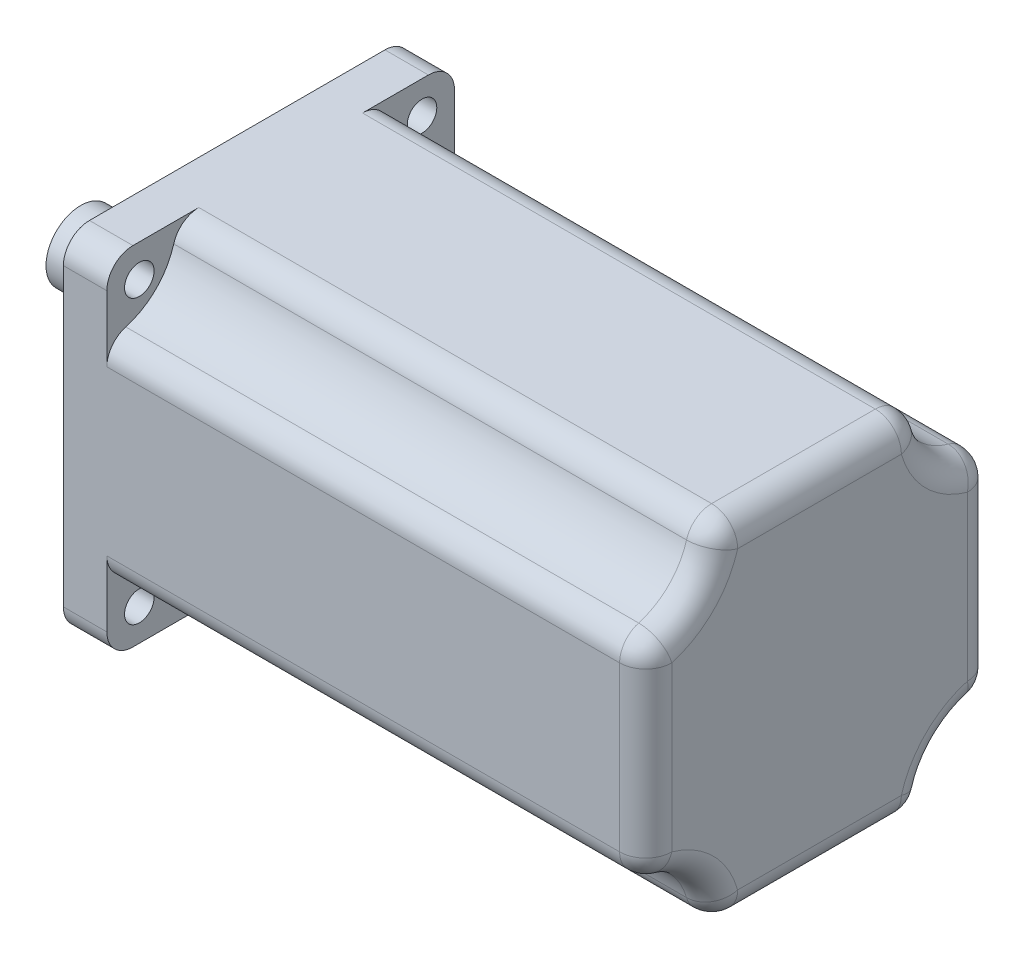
ISO-10303-21;
HEADER;
FILE_DESCRIPTION(('STEP AP214'),'2;1');
FILE_NAME('part.step','',(''),(''),'','','');
FILE_SCHEMA(('AUTOMOTIVE_DESIGN { 1 0 10303 214 1 1 1 1 }'));
ENDSEC;
DATA;
#1=APPLICATION_CONTEXT('core data for automotive mechanical design processes');
#2=APPLICATION_PROTOCOL_DEFINITION('international standard','automotive_design',2000,#1);
#3=PRODUCT_CONTEXT('',#1,'mechanical');
#4=PRODUCT('Part','Part','',(#3));
#5=PRODUCT_RELATED_PRODUCT_CATEGORY('part','',(#4));
#6=PRODUCT_DEFINITION_FORMATION('','',#4);
#7=PRODUCT_DEFINITION_CONTEXT('part definition',#1,'design');
#8=PRODUCT_DEFINITION('design','',#6,#7);
#9=PRODUCT_DEFINITION_SHAPE('','',#8);
#10=(LENGTH_UNIT() NAMED_UNIT(*) SI_UNIT(.MILLI.,.METRE.));
#11=(NAMED_UNIT(*) PLANE_ANGLE_UNIT() SI_UNIT($,.RADIAN.));
#12=(NAMED_UNIT(*) SI_UNIT($,.STERADIAN.) SOLID_ANGLE_UNIT());
#13=UNCERTAINTY_MEASURE_WITH_UNIT(LENGTH_MEASURE(1.E-05),#10,'distance_accuracy_value','');
#14=(GEOMETRIC_REPRESENTATION_CONTEXT(3) GLOBAL_UNCERTAINTY_ASSIGNED_CONTEXT((#13)) GLOBAL_UNIT_ASSIGNED_CONTEXT((#10,
#11,#12)) REPRESENTATION_CONTEXT('',''));
#15=CARTESIAN_POINT('',(0.,0.,0.));
#16=DIRECTION('',(0.,0.,1.));
#17=DIRECTION('',(1.,0.,0.));
#18=AXIS2_PLACEMENT_3D('',#15,#16,#17);
#19=CARTESIAN_POINT('',(-18.,0.,0.));
#20=DIRECTION('',(-1.,0.,0.));
#21=DIRECTION('',(0.,0.,1.));
#22=AXIS2_PLACEMENT_3D('',#19,#20,#21);
#23=PLANE('',#22);
#24=CARTESIAN_POINT('',(-18.,0.,0.));
#25=DIRECTION('',(-1.,0.,0.));
#26=DIRECTION('',(0.,0.,1.));
#27=AXIS2_PLACEMENT_3D('',#24,#25,#26);
#28=CIRCLE('',#27,4.);
#29=CARTESIAN_POINT('',(-18.,0.,4.));
#30=VERTEX_POINT('',#29);
#31=EDGE_CURVE('E19',#30,#30,#28,.F.);
#32=ORIENTED_EDGE('',*,*,#31,.F.);
#33=EDGE_LOOP('',(#32));
#34=FACE_BOUND('',#33,.T.);
#35=ADVANCED_FACE('F16',(#34),#23,.T.);
#36=CARTESIAN_POINT('',(-3.,0.,0.));
#37=DIRECTION('',(-1.,0.,0.));
#38=DIRECTION('',(0.,0.,1.));
#39=AXIS2_PLACEMENT_3D('',#36,#37,#38);
#40=CYLINDRICAL_SURFACE('',#39,4.);
#41=ORIENTED_EDGE('',*,*,#31,.T.);
#42=EDGE_LOOP('',(#41));
#43=FACE_BOUND('',#42,.T.);
#44=CARTESIAN_POINT('',(-3.,0.,0.));
#45=DIRECTION('',(-1.,0.,0.));
#46=DIRECTION('',(0.,0.,1.));
#47=AXIS2_PLACEMENT_3D('',#44,#45,#46);
#48=CIRCLE('',#47,4.);
#49=CARTESIAN_POINT('',(-3.,0.,4.));
#50=VERTEX_POINT('',#49);
#51=EDGE_CURVE('E289',#50,#50,#48,.F.);
#52=ORIENTED_EDGE('',*,*,#51,.F.);
#53=EDGE_LOOP('',(#52));
#54=FACE_BOUND('',#53,.T.);
#55=ADVANCED_FACE('F382',(#43,#54),#40,.T.);
#56=CARTESIAN_POINT('',(64.,9.416994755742,-17.));
#57=DIRECTION('',(0.,1.,-2.796664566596E-10));
#58=DIRECTION('',(1.,0.,0.));
#59=AXIS2_PLACEMENT_3D('',#56,#57,#58);
#60=SPHERICAL_SURFACE('',#59,3.);
#61=CARTESIAN_POINT('',(64.,9.416994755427,-17.));
#62=DIRECTION('',(0.,1.,0.));
#63=DIRECTION('',(0.,0.,1.));
#64=AXIS2_PLACEMENT_3D('',#61,#62,#63);
#65=CIRCLE('',#64,3.);
#66=CARTESIAN_POINT('',(64.,9.4169947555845,-20.));
#67=VERTEX_POINT('',#66);
#68=CARTESIAN_POINT('',(67.,9.41699475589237,-17.0000000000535));
#69=VERTEX_POINT('',#68);
#70=EDGE_CURVE('E265',#67,#69,#65,.F.);
#71=ORIENTED_EDGE('',*,*,#70,.F.);
#72=CARTESIAN_POINT('',(64.,9.416994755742,-17.));
#73=DIRECTION('',(1.,0.,0.));
#74=DIRECTION('',(0.,0.,-1.));
#75=AXIS2_PLACEMENT_3D('',#72,#73,#74);
#76=CIRCLE('',#75,3.);
#77=CARTESIAN_POINT('',(64.,12.3032689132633,-17.8181818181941));
#78=VERTEX_POINT('',#77);
#79=EDGE_CURVE('E666',#78,#67,#76,.F.);
#80=ORIENTED_EDGE('',*,*,#79,.F.);
#81=CARTESIAN_POINT('',(64.,9.41699475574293,-16.9999999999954));
#82=DIRECTION('',(0.,-0.272727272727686,-0.962091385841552));
#83=DIRECTION('',(0.,-0.962091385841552,0.272727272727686));
#84=AXIS2_PLACEMENT_3D('',#81,#82,#83);
#85=CIRCLE('',#84,3.);
#86=EDGE_CURVE('E262',#69,#78,#85,.F.);
#87=ORIENTED_EDGE('',*,*,#86,.F.);
#88=EDGE_LOOP('',(#71,#80,#87));
#89=FACE_BOUND('',#88,.T.);
#90=ADVANCED_FACE('F379',(#89),#60,.T.);
#91=CARTESIAN_POINT('',(67.,20.,-20.));
#92=DIRECTION('',(1.,0.,0.));
#93=DIRECTION('',(0.,0.,-1.));
#94=AXIS2_PLACEMENT_3D('',#91,#92,#93);
#95=CYLINDRICAL_SURFACE('',#94,8.);
#96=CARTESIAN_POINT('',(5.,20.,-20.));
#97=DIRECTION('',(1.,0.,0.));
#98=DIRECTION('',(0.,0.,-1.));
#99=AXIS2_PLACEMENT_3D('',#96,#97,#98);
#100=CIRCLE('',#99,8.);
#101=CARTESIAN_POINT('',(5.,17.8181818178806,-12.3032689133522));
#102=VERTEX_POINT('',#101);
#103=CARTESIAN_POINT('',(5.,12.3032689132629,-17.8181818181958));
#104=VERTEX_POINT('',#103);
#105=EDGE_CURVE('E284',#102,#104,#100,.T.);
#106=ORIENTED_EDGE('',*,*,#105,.F.);
#107=DIRECTION('',(-1.,0.,0.));
#108=VECTOR('',#107,1.);
#109=CARTESIAN_POINT('',(177.806,17.8181818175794,-12.3032689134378));
#110=LINE('',#109,#108);
#111=CARTESIAN_POINT('',(64.,17.8181818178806,-12.3032689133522));
#112=VERTEX_POINT('',#111);
#113=EDGE_CURVE('E335',#112,#102,#110,.T.);
#114=ORIENTED_EDGE('',*,*,#113,.F.);
#115=CARTESIAN_POINT('',(64.,20.,-20.));
#116=DIRECTION('',(1.,0.,0.));
#117=DIRECTION('',(0.,-0.969319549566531,0.245804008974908));
#118=AXIS2_PLACEMENT_3D('',#115,#116,#117);
#119=CIRCLE('',#118,8.);
#120=EDGE_CURVE('E259',#78,#112,#119,.F.);
#121=ORIENTED_EDGE('',*,*,#120,.F.);
#122=DIRECTION('',(1.,0.,0.));
#123=VECTOR('',#122,1.);
#124=CARTESIAN_POINT('',(-128.806,12.3032689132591,-17.8181818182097));
#125=LINE('',#124,#123);
#126=EDGE_CURVE('E283',#104,#78,#125,.T.);
#127=ORIENTED_EDGE('',*,*,#126,.F.);
#128=EDGE_LOOP('',(#106,#114,#121,#127));
#129=FACE_BOUND('',#128,.T.);
#130=ADVANCED_FACE('F381',(#129),#95,.F.);
#131=CARTESIAN_POINT('',(64.,17.,-9.416994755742));
#132=DIRECTION('',(0.,0.,1.));
#133=DIRECTION('',(1.,0.,0.));
#134=AXIS2_PLACEMENT_3D('',#131,#132,#133);
#135=SPHERICAL_SURFACE('',#134,3.);
#136=CARTESIAN_POINT('',(64.,16.9999999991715,-9.4169947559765));
#137=DIRECTION('',(0.,-0.962091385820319,-0.27272727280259));
#138=DIRECTION('',(0.,-0.27272727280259,0.962091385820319));
#139=AXIS2_PLACEMENT_3D('',#136,#137,#138);
#140=CIRCLE('',#139,3.);
#141=CARTESIAN_POINT('',(67.,16.9999999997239,-9.41699475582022));
#142=VERTEX_POINT('',#141);
#143=EDGE_CURVE('E255',#112,#142,#140,.T.);
#144=ORIENTED_EDGE('',*,*,#143,.F.);
#145=CARTESIAN_POINT('',(64.,17.,-9.416994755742));
#146=DIRECTION('',(-1.,0.,0.));
#147=DIRECTION('',(0.,0.,1.));
#148=AXIS2_PLACEMENT_3D('',#145,#146,#147);
#149=CIRCLE('',#148,3.);
#150=CARTESIAN_POINT('',(64.,20.,-9.4169947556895));
#151=VERTEX_POINT('',#150);
#152=EDGE_CURVE('E305',#151,#112,#149,.T.);
#153=ORIENTED_EDGE('',*,*,#152,.F.);
#154=CARTESIAN_POINT('',(64.,17.,-9.416994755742));
#155=DIRECTION('',(0.,0.,1.));
#156=DIRECTION('',(1.,0.,0.));
#157=AXIS2_PLACEMENT_3D('',#154,#155,#156);
#158=CIRCLE('',#157,3.);
#159=EDGE_CURVE('E258',#142,#151,#158,.T.);
#160=ORIENTED_EDGE('',*,*,#159,.F.);
#161=EDGE_LOOP('',(#144,#153,#160));
#162=FACE_BOUND('',#161,.T.);
#163=ADVANCED_FACE('F363',(#162),#135,.T.);
#164=CARTESIAN_POINT('',(64.,17.,9.416994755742));
#165=DIRECTION('',(0.,0.,1.));
#166=DIRECTION('',(1.,0.,0.));
#167=AXIS2_PLACEMENT_3D('',#164,#165,#166);
#168=SPHERICAL_SURFACE('',#167,3.);
#169=CARTESIAN_POINT('',(64.,17.,9.416994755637));
#170=DIRECTION('',(0.,0.,1.));
#171=DIRECTION('',(1.,0.,0.));
#172=AXIS2_PLACEMENT_3D('',#169,#170,#171);
#173=CIRCLE('',#172,3.);
#174=CARTESIAN_POINT('',(64.,20.,9.41699475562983));
#175=VERTEX_POINT('',#174);
#176=CARTESIAN_POINT('',(67.,17.,9.41699475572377));
#177=VERTEX_POINT('',#176);
#178=EDGE_CURVE('E252',#175,#177,#173,.F.);
#179=ORIENTED_EDGE('',*,*,#178,.F.);
#180=CARTESIAN_POINT('',(64.,17.,9.416994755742));
#181=DIRECTION('',(1.,0.,0.));
#182=DIRECTION('',(0.,0.,-1.));
#183=AXIS2_PLACEMENT_3D('',#180,#181,#182);
#184=CIRCLE('',#183,3.);
#185=CARTESIAN_POINT('',(64.,17.8181818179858,12.3032689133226));
#186=VERTEX_POINT('',#185);
#187=EDGE_CURVE('E304',#186,#175,#184,.F.);
#188=ORIENTED_EDGE('',*,*,#187,.F.);
#189=CARTESIAN_POINT('',(64.,17.0000000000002,9.41699475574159));
#190=DIRECTION('',(0.,0.962091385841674,-0.272727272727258));
#191=DIRECTION('',(0.,-0.272727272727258,-0.962091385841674));
#192=AXIS2_PLACEMENT_3D('',#189,#190,#191);
#193=CIRCLE('',#192,3.);
#194=EDGE_CURVE('E249',#177,#186,#193,.F.);
#195=ORIENTED_EDGE('',*,*,#194,.F.);
#196=EDGE_LOOP('',(#179,#188,#195));
#197=FACE_BOUND('',#196,.T.);
#198=ADVANCED_FACE('F359',(#197),#168,.T.);
#199=CARTESIAN_POINT('',(67.,20.,20.));
#200=DIRECTION('',(1.,0.,0.));
#201=DIRECTION('',(0.,0.,-1.));
#202=AXIS2_PLACEMENT_3D('',#199,#200,#201);
#203=CYLINDRICAL_SURFACE('',#202,8.);
#204=CARTESIAN_POINT('',(5.,20.,20.));
#205=DIRECTION('',(1.,0.,0.));
#206=DIRECTION('',(0.,0.,-1.));
#207=AXIS2_PLACEMENT_3D('',#204,#205,#206);
#208=CIRCLE('',#207,8.);
#209=CARTESIAN_POINT('',(5.,12.3032689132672,17.8181818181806));
#210=VERTEX_POINT('',#209);
#211=CARTESIAN_POINT('',(5.,17.8181818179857,12.3032689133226));
#212=VERTEX_POINT('',#211);
#213=EDGE_CURVE('E211',#210,#212,#208,.T.);
#214=ORIENTED_EDGE('',*,*,#213,.F.);
#215=DIRECTION('',(-1.,0.,0.));
#216=VECTOR('',#215,1.);
#217=CARTESIAN_POINT('',(177.806,12.3032689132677,17.8181818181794));
#218=LINE('',#217,#216);
#219=CARTESIAN_POINT('',(64.,12.3032689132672,17.8181818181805));
#220=VERTEX_POINT('',#219);
#221=EDGE_CURVE('E207',#220,#210,#218,.T.);
#222=ORIENTED_EDGE('',*,*,#221,.F.);
#223=CARTESIAN_POINT('',(64.,20.,20.));
#224=DIRECTION('',(1.,0.,0.));
#225=DIRECTION('',(0.,-0.245804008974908,-0.969319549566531));
#226=AXIS2_PLACEMENT_3D('',#223,#224,#225);
#227=CIRCLE('',#226,8.);
#228=EDGE_CURVE('E246',#186,#220,#227,.F.);
#229=ORIENTED_EDGE('',*,*,#228,.F.);
#230=DIRECTION('',(1.,0.,0.));
#231=VECTOR('',#230,1.);
#232=CARTESIAN_POINT('',(-128.806,17.8181818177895,12.3032689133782));
#233=LINE('',#232,#231);
#234=EDGE_CURVE('E301',#212,#186,#233,.T.);
#235=ORIENTED_EDGE('',*,*,#234,.F.);
#236=EDGE_LOOP('',(#214,#222,#229,#235));
#237=FACE_BOUND('',#236,.T.);
#238=ADVANCED_FACE('F297',(#237),#203,.F.);
#239=CARTESIAN_POINT('',(64.,9.416994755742,17.));
#240=DIRECTION('',(0.,-1.,0.));
#241=DIRECTION('',(1.,0.,0.));
#242=AXIS2_PLACEMENT_3D('',#239,#240,#241);
#243=SPHERICAL_SURFACE('',#242,3.);
#244=CARTESIAN_POINT('',(64.,9.41699475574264,16.9999999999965));
#245=DIRECTION('',(0.,0.272727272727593,-0.962091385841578));
#246=DIRECTION('',(0.,-0.962091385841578,-0.272727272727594));
#247=AXIS2_PLACEMENT_3D('',#244,#245,#246);
#248=CIRCLE('',#247,3.);
#249=CARTESIAN_POINT('',(67.,9.41699475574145,16.9999999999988));
#250=VERTEX_POINT('',#249);
#251=EDGE_CURVE('E242',#220,#250,#248,.T.);
#252=ORIENTED_EDGE('',*,*,#251,.F.);
#253=CARTESIAN_POINT('',(64.,9.416994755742,17.));
#254=DIRECTION('',(-1.,0.,0.));
#255=DIRECTION('',(0.,0.,1.));
#256=AXIS2_PLACEMENT_3D('',#253,#254,#255);
#257=CIRCLE('',#256,3.);
#258=CARTESIAN_POINT('',(64.,9.4169947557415,20.));
#259=VERTEX_POINT('',#258);
#260=EDGE_CURVE('E212',#259,#220,#257,.T.);
#261=ORIENTED_EDGE('',*,*,#260,.F.);
#262=CARTESIAN_POINT('',(64.,9.416994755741,17.));
#263=DIRECTION('',(0.,-1.,0.));
#264=DIRECTION('',(0.,0.,-1.));
#265=AXIS2_PLACEMENT_3D('',#262,#263,#264);
#266=CIRCLE('',#265,3.);
#267=EDGE_CURVE('E659',#250,#259,#266,.T.);
#268=ORIENTED_EDGE('',*,*,#267,.F.);
#269=EDGE_LOOP('',(#252,#261,#268));
#270=FACE_BOUND('',#269,.T.);
#271=ADVANCED_FACE('F351',(#270),#243,.T.);
#272=CARTESIAN_POINT('',(64.,-9.416994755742,17.));
#273=DIRECTION('',(0.,-1.,2.796664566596E-10));
#274=DIRECTION('',(1.,0.,0.));
#275=AXIS2_PLACEMENT_3D('',#272,#273,#274);
#276=SPHERICAL_SURFACE('',#275,3.);
#277=CARTESIAN_POINT('',(64.,-9.416994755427,17.));
#278=DIRECTION('',(0.,-1.,0.));
#279=DIRECTION('',(0.,0.,-1.));
#280=AXIS2_PLACEMENT_3D('',#277,#278,#279);
#281=CIRCLE('',#280,3.);
#282=CARTESIAN_POINT('',(64.,-9.4169947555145,20.));
#283=VERTEX_POINT('',#282);
#284=CARTESIAN_POINT('',(67.,-9.41699475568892,17.0000000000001));
#285=VERTEX_POINT('',#284);
#286=EDGE_CURVE('E277',#283,#285,#281,.F.);
#287=ORIENTED_EDGE('',*,*,#286,.F.);
#288=CARTESIAN_POINT('',(64.,-9.416994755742,17.));
#289=DIRECTION('',(1.,0.,0.));
#290=DIRECTION('',(0.,0.,-1.));
#291=AXIS2_PLACEMENT_3D('',#288,#289,#290);
#292=CIRCLE('',#291,3.);
#293=CARTESIAN_POINT('',(64.,-12.3032689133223,17.8181818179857));
#294=VERTEX_POINT('',#293);
#295=EDGE_CURVE('E245',#294,#283,#292,.F.);
#296=ORIENTED_EDGE('',*,*,#295,.F.);
#297=CARTESIAN_POINT('',(64.,-9.41699475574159,17.0000000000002));
#298=DIRECTION('',(0.,0.272727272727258,0.962091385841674));
#299=DIRECTION('',(0.,0.962091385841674,-0.272727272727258));
#300=AXIS2_PLACEMENT_3D('',#297,#298,#299);
#301=CIRCLE('',#300,3.);
#302=EDGE_CURVE('E272',#285,#294,#301,.F.);
#303=ORIENTED_EDGE('',*,*,#302,.F.);
#304=EDGE_LOOP('',(#287,#296,#303));
#305=FACE_BOUND('',#304,.T.);
#306=ADVANCED_FACE('F346',(#305),#276,.T.);
#307=CARTESIAN_POINT('',(177.806,17.,-9.416994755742));
#308=DIRECTION('',(-1.,0.,0.));
#309=DIRECTION('',(0.,0.,1.));
#310=AXIS2_PLACEMENT_3D('',#307,#308,#309);
#311=CYLINDRICAL_SURFACE('',#310,3.);
#312=DIRECTION('',(1.,0.,0.));
#313=VECTOR('',#312,1.);
#314=CARTESIAN_POINT('',(0.,20.,-9.416994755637));
#315=LINE('',#314,#313);
#316=CARTESIAN_POINT('',(5.,20.,-9.4169947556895));
#317=VERTEX_POINT('',#316);
#318=EDGE_CURVE('E240',#151,#317,#315,.F.);
#319=ORIENTED_EDGE('',*,*,#318,.F.);
#320=ORIENTED_EDGE('',*,*,#152,.T.);
#321=ORIENTED_EDGE('',*,*,#113,.T.);
#322=CARTESIAN_POINT('',(5.,17.,-9.416994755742));
#323=DIRECTION('',(-1.,0.,0.));
#324=DIRECTION('',(0.,0.,1.));
#325=AXIS2_PLACEMENT_3D('',#322,#323,#324);
#326=CIRCLE('',#325,3.);
#327=EDGE_CURVE('E286',#317,#102,#326,.T.);
#328=ORIENTED_EDGE('',*,*,#327,.F.);
#329=EDGE_LOOP('',(#319,#320,#321,#328));
#330=FACE_BOUND('',#329,.T.);
#331=ADVANCED_FACE('F350',(#330),#311,.T.);
#332=CARTESIAN_POINT('',(-128.806,17.,9.416994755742));
#333=DIRECTION('',(1.,0.,0.));
#334=DIRECTION('',(0.,0.,-1.));
#335=AXIS2_PLACEMENT_3D('',#332,#333,#334);
#336=CYLINDRICAL_SURFACE('',#335,3.);
#337=ORIENTED_EDGE('',*,*,#234,.T.);
#338=ORIENTED_EDGE('',*,*,#187,.T.);
#339=DIRECTION('',(1.,0.,0.));
#340=VECTOR('',#339,1.);
#341=CARTESIAN_POINT('',(0.,20.,9.416994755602));
#342=LINE('',#341,#340);
#343=CARTESIAN_POINT('',(5.,20.,9.416994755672));
#344=VERTEX_POINT('',#343);
#345=EDGE_CURVE('E309',#344,#175,#342,.T.);
#346=ORIENTED_EDGE('',*,*,#345,.F.);
#347=CARTESIAN_POINT('',(5.,17.,9.416994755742));
#348=DIRECTION('',(1.,0.,0.));
#349=DIRECTION('',(0.,0.,-1.));
#350=AXIS2_PLACEMENT_3D('',#347,#348,#349);
#351=CIRCLE('',#350,3.);
#352=EDGE_CURVE('E292',#212,#344,#351,.F.);
#353=ORIENTED_EDGE('',*,*,#352,.F.);
#354=EDGE_LOOP('',(#337,#338,#346,#353));
#355=FACE_BOUND('',#354,.T.);
#356=ADVANCED_FACE('F307',(#355),#336,.T.);
#357=CARTESIAN_POINT('',(177.806,9.416994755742,17.));
#358=DIRECTION('',(-1.,0.,0.));
#359=DIRECTION('',(0.,0.,1.));
#360=AXIS2_PLACEMENT_3D('',#357,#358,#359);
#361=CYLINDRICAL_SURFACE('',#360,3.);
#362=DIRECTION('',(1.,0.,0.));
#363=VECTOR('',#362,1.);
#364=CARTESIAN_POINT('',(0.,9.416994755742,20.));
#365=LINE('',#364,#363);
#366=CARTESIAN_POINT('',(5.,9.416994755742,20.));
#367=VERTEX_POINT('',#366);
#368=EDGE_CURVE('E205',#259,#367,#365,.F.);
#369=ORIENTED_EDGE('',*,*,#368,.F.);
#370=ORIENTED_EDGE('',*,*,#260,.T.);
#371=ORIENTED_EDGE('',*,*,#221,.T.);
#372=CARTESIAN_POINT('',(5.,9.416994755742,17.));
#373=DIRECTION('',(-1.,0.,0.));
#374=DIRECTION('',(0.,0.,1.));
#375=AXIS2_PLACEMENT_3D('',#372,#373,#374);
#376=CIRCLE('',#375,3.);
#377=EDGE_CURVE('E200',#367,#210,#376,.T.);
#378=ORIENTED_EDGE('',*,*,#377,.F.);
#379=EDGE_LOOP('',(#369,#370,#371,#378));
#380=FACE_BOUND('',#379,.T.);
#381=ADVANCED_FACE('F202',(#380),#361,.T.);
#382=CARTESIAN_POINT('',(5.,0.,0.));
#383=DIRECTION('',(1.,0.,0.));
#384=DIRECTION('',(0.,0.,-1.));
#385=AXIS2_PLACEMENT_3D('',#382,#383,#384);
#386=PLANE('',#385);
#387=CARTESIAN_POINT('',(5.,16.26345596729,16.26345596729));
#388=DIRECTION('',(1.,0.,0.));
#389=DIRECTION('',(0.,0.,-1.));
#390=AXIS2_PLACEMENT_3D('',#387,#388,#389);
#391=CIRCLE('',#390,1.7);
#392=CARTESIAN_POINT('',(5.,16.26345596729,14.56345596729));
#393=VERTEX_POINT('',#392);
#394=EDGE_CURVE('E742',#393,#393,#391,.F.);
#395=ORIENTED_EDGE('',*,*,#394,.T.);
#396=EDGE_LOOP('',(#395));
#397=FACE_BOUND('',#396,.T.);
#398=ORIENTED_EDGE('',*,*,#352,.T.);
#399=DIRECTION('',(0.,0.,1.));
#400=VECTOR('',#399,1.);
#401=CARTESIAN_POINT('',(5.,20.,-20.));
#402=LINE('',#401,#400);
#403=CARTESIAN_POINT('',(5.,20.,17.));
#404=VERTEX_POINT('',#403);
#405=EDGE_CURVE('E314',#404,#344,#402,.F.);
#406=ORIENTED_EDGE('',*,*,#405,.F.);
#407=CARTESIAN_POINT('',(5.,17.,17.));
#408=DIRECTION('',(-1.,0.,0.));
#409=DIRECTION('',(0.,0.,1.));
#410=AXIS2_PLACEMENT_3D('',#407,#408,#409);
#411=CIRCLE('',#410,3.);
#412=CARTESIAN_POINT('',(5.,17.,20.));
#413=VERTEX_POINT('',#412);
#414=EDGE_CURVE('E217',#413,#404,#411,.T.);
#415=ORIENTED_EDGE('',*,*,#414,.F.);
#416=DIRECTION('',(0.,1.,0.));
#417=VECTOR('',#416,1.);
#418=CARTESIAN_POINT('',(5.,20.,20.));
#419=LINE('',#418,#417);
#420=EDGE_CURVE('E214',#367,#413,#419,.T.);
#421=ORIENTED_EDGE('',*,*,#420,.F.);
#422=ORIENTED_EDGE('',*,*,#377,.T.);
#423=ORIENTED_EDGE('',*,*,#213,.T.);
#424=EDGE_LOOP('',(#398,#406,#415,#421,#422,#423));
#425=FACE_BOUND('',#424,.T.);
#426=ADVANCED_FACE('F215',(#397,#425),#386,.T.);
#427=CARTESIAN_POINT('',(-3.,0.,0.));
#428=DIRECTION('',(-1.,0.,0.));
#429=DIRECTION('',(0.,0.,1.));
#430=AXIS2_PLACEMENT_3D('',#427,#428,#429);
#431=PLANE('',#430);
#432=ORIENTED_EDGE('',*,*,#51,.T.);
#433=EDGE_LOOP('',(#432));
#434=FACE_BOUND('',#433,.T.);
#435=CARTESIAN_POINT('',(-3.,0.,0.));
#436=DIRECTION('',(-1.,0.,0.));
#437=DIRECTION('',(0.,0.,1.));
#438=AXIS2_PLACEMENT_3D('',#435,#436,#437);
#439=CIRCLE('',#438,15.);
#440=CARTESIAN_POINT('',(-3.,0.,15.));
#441=VERTEX_POINT('',#440);
#442=EDGE_CURVE('E755',#441,#441,#439,.F.);
#443=ORIENTED_EDGE('',*,*,#442,.F.);
#444=EDGE_LOOP('',(#443));
#445=FACE_BOUND('',#444,.T.);
#446=ADVANCED_FACE('F697',(#434,#445),#431,.T.);
#447=CARTESIAN_POINT('',(5.,0.,0.));
#448=DIRECTION('',(1.,0.,0.));
#449=DIRECTION('',(0.,0.,-1.));
#450=AXIS2_PLACEMENT_3D('',#447,#448,#449);
#451=PLANE('',#450);
#452=CARTESIAN_POINT('',(5.,16.26345596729,-16.26345596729));
#453=DIRECTION('',(1.,0.,0.));
#454=DIRECTION('',(0.,0.,-1.));
#455=AXIS2_PLACEMENT_3D('',#452,#453,#454);
#456=CIRCLE('',#455,1.7);
#457=CARTESIAN_POINT('',(5.,16.26345596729,-17.96345596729));
#458=VERTEX_POINT('',#457);
#459=EDGE_CURVE('E234',#458,#458,#456,.F.);
#460=ORIENTED_EDGE('',*,*,#459,.T.);
#461=EDGE_LOOP('',(#460));
#462=FACE_BOUND('',#461,.T.);
#463=CARTESIAN_POINT('',(5.,9.416994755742,-17.));
#464=DIRECTION('',(1.,0.,0.));
#465=DIRECTION('',(0.,0.,-1.));
#466=AXIS2_PLACEMENT_3D('',#463,#464,#465);
#467=CIRCLE('',#466,3.);
#468=CARTESIAN_POINT('',(5.,9.416994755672,-20.));
#469=VERTEX_POINT('',#468);
#470=EDGE_CURVE('E280',#469,#104,#467,.T.);
#471=ORIENTED_EDGE('',*,*,#470,.F.);
#472=DIRECTION('',(0.,1.,0.));
#473=VECTOR('',#472,1.);
#474=CARTESIAN_POINT('',(5.,-20.,-20.));
#475=LINE('',#474,#473);
#476=CARTESIAN_POINT('',(5.,17.,-20.));
#477=VERTEX_POINT('',#476);
#478=EDGE_CURVE('E729',#477,#469,#475,.F.);
#479=ORIENTED_EDGE('',*,*,#478,.F.);
#480=CARTESIAN_POINT('',(5.,17.,-17.));
#481=DIRECTION('',(-1.,0.,0.));
#482=DIRECTION('',(0.,0.,1.));
#483=AXIS2_PLACEMENT_3D('',#480,#481,#482);
#484=CIRCLE('',#483,3.);
#485=CARTESIAN_POINT('',(5.,20.,-17.));
#486=VERTEX_POINT('',#485);
#487=EDGE_CURVE('E238',#486,#477,#484,.T.);
#488=ORIENTED_EDGE('',*,*,#487,.F.);
#489=DIRECTION('',(0.,0.,1.));
#490=VECTOR('',#489,1.);
#491=CARTESIAN_POINT('',(5.,20.,-20.));
#492=LINE('',#491,#490);
#493=EDGE_CURVE('E321',#317,#486,#492,.F.);
#494=ORIENTED_EDGE('',*,*,#493,.F.);
#495=ORIENTED_EDGE('',*,*,#327,.T.);
#496=ORIENTED_EDGE('',*,*,#105,.T.);
#497=EDGE_LOOP('',(#471,#479,#488,#494,#495,#496));
#498=FACE_BOUND('',#497,.T.);
#499=ADVANCED_FACE('F693',(#462,#498),#451,.T.);
#500=CARTESIAN_POINT('',(-128.806,9.416994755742,-17.));
#501=DIRECTION('',(1.,0.,0.));
#502=DIRECTION('',(0.,0.,-1.));
#503=AXIS2_PLACEMENT_3D('',#500,#501,#502);
#504=CYLINDRICAL_SURFACE('',#503,3.);
#505=ORIENTED_EDGE('',*,*,#126,.T.);
#506=ORIENTED_EDGE('',*,*,#79,.T.);
#507=DIRECTION('',(-1.,0.,0.));
#508=VECTOR('',#507,1.);
#509=CARTESIAN_POINT('',(0.,9.416994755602,-20.));
#510=LINE('',#509,#508);
#511=EDGE_CURVE('E732',#469,#67,#510,.F.);
#512=ORIENTED_EDGE('',*,*,#511,.F.);
#513=ORIENTED_EDGE('',*,*,#470,.T.);
#514=EDGE_LOOP('',(#505,#506,#512,#513));
#515=FACE_BOUND('',#514,.T.);
#516=ADVANCED_FACE('F689',(#515),#504,.T.);
#517=CARTESIAN_POINT('',(64.,-9.416994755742,-17.));
#518=DIRECTION('',(0.,1.,0.));
#519=DIRECTION('',(1.,0.,0.));
#520=AXIS2_PLACEMENT_3D('',#517,#518,#519);
#521=SPHERICAL_SURFACE('',#520,3.);
#522=CARTESIAN_POINT('',(64.,-9.4169947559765,-16.9999999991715));
#523=DIRECTION('',(0.,-0.27272727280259,0.962091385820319));
#524=DIRECTION('',(0.,0.962091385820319,0.27272727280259));
#525=AXIS2_PLACEMENT_3D('',#522,#523,#524);
#526=CIRCLE('',#525,3.);
#527=CARTESIAN_POINT('',(64.,-12.3032689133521,-17.8181818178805));
#528=VERTEX_POINT('',#527);
#529=CARTESIAN_POINT('',(67.,-9.41699475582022,-16.9999999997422));
#530=VERTEX_POINT('',#529);
#531=EDGE_CURVE('E268',#528,#530,#526,.T.);
#532=ORIENTED_EDGE('',*,*,#531,.F.);
#533=CARTESIAN_POINT('',(64.,-9.416994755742,-17.));
#534=DIRECTION('',(-1.,0.,0.));
#535=DIRECTION('',(0.,0.,1.));
#536=AXIS2_PLACEMENT_3D('',#533,#534,#535);
#537=CIRCLE('',#536,3.);
#538=CARTESIAN_POINT('',(64.,-9.41699475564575,-20.));
#539=VERTEX_POINT('',#538);
#540=EDGE_CURVE('E673',#539,#528,#537,.T.);
#541=ORIENTED_EDGE('',*,*,#540,.F.);
#542=CARTESIAN_POINT('',(64.,-9.416994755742,-17.));
#543=DIRECTION('',(0.,1.,0.));
#544=DIRECTION('',(0.,0.,1.));
#545=AXIS2_PLACEMENT_3D('',#542,#543,#544);
#546=CIRCLE('',#545,3.);
#547=EDGE_CURVE('E271',#530,#539,#546,.T.);
#548=ORIENTED_EDGE('',*,*,#547,.F.);
#549=EDGE_LOOP('',(#532,#541,#548));
#550=FACE_BOUND('',#549,.T.);
#551=ADVANCED_FACE('F685',(#550),#521,.T.);
#552=CARTESIAN_POINT('',(64.,17.15699529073,17.));
#553=DIRECTION('',(0.,-1.,0.));
#554=DIRECTION('',(0.,0.,-1.));
#555=AXIS2_PLACEMENT_3D('',#552,#553,#554);
#556=CYLINDRICAL_SURFACE('',#555,3.);
#557=ORIENTED_EDGE('',*,*,#286,.T.);
#558=DIRECTION('',(0.,1.,0.));
#559=VECTOR('',#558,1.);
#560=CARTESIAN_POINT('',(67.,0.,17.));
#561=LINE('',#560,#559);
#562=EDGE_CURVE('E483',#250,#285,#561,.F.);
#563=ORIENTED_EDGE('',*,*,#562,.F.);
#564=ORIENTED_EDGE('',*,*,#267,.T.);
#565=DIRECTION('',(0.,1.,0.));
#566=VECTOR('',#565,1.);
#567=CARTESIAN_POINT('',(64.,20.,20.));
#568=LINE('',#567,#566);
#569=EDGE_CURVE('E227',#283,#259,#568,.T.);
#570=ORIENTED_EDGE('',*,*,#569,.F.);
#571=EDGE_LOOP('',(#557,#563,#564,#570));
#572=FACE_BOUND('',#571,.T.);
#573=ADVANCED_FACE('F688',(#572),#556,.T.);
#574=CARTESIAN_POINT('',(64.,-20.,20.));
#575=DIRECTION('',(1.,0.,0.));
#576=DIRECTION('',(0.,0.969319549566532,-0.245804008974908));
#577=AXIS2_PLACEMENT_3D('',#574,#575,#576);
#578=TOROIDAL_SURFACE('',#577,11.,3.);
#579=CARTESIAN_POINT('',(64.,-16.9999999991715,9.4169947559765));
#580=DIRECTION('',(0.,0.962091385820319,0.27272727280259));
#581=DIRECTION('',(0.,0.27272727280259,-0.962091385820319));
#582=AXIS2_PLACEMENT_3D('',#579,#580,#581);
#583=CIRCLE('',#582,3.);
#584=CARTESIAN_POINT('',(67.,-16.9999999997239,9.41699475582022));
#585=VERTEX_POINT('',#584);
#586=CARTESIAN_POINT('',(64.,-17.8181818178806,12.3032689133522));
#587=VERTEX_POINT('',#586);
#588=EDGE_CURVE('E766',#585,#587,#583,.F.);
#589=ORIENTED_EDGE('',*,*,#588,.F.);
#590=CARTESIAN_POINT('',(67.,-20.,20.));
#591=DIRECTION('',(1.,0.,0.));
#592=DIRECTION('',(0.,0.27272727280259,-0.962091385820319));
#593=AXIS2_PLACEMENT_3D('',#590,#591,#592);
#594=CIRCLE('',#593,10.9999999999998);
#595=EDGE_CURVE('E500',#285,#585,#594,.F.);
#596=ORIENTED_EDGE('',*,*,#595,.F.);
#597=ORIENTED_EDGE('',*,*,#302,.T.);
#598=CARTESIAN_POINT('',(64.,-20.,20.));
#599=DIRECTION('',(1.,0.,0.));
#600=DIRECTION('',(0.,0.,-1.));
#601=AXIS2_PLACEMENT_3D('',#598,#599,#600);
#602=CIRCLE('',#601,8.);
#603=EDGE_CURVE('E589',#294,#587,#602,.F.);
#604=ORIENTED_EDGE('',*,*,#603,.T.);
#605=EDGE_LOOP('',(#589,#596,#597,#604));
#606=FACE_BOUND('',#605,.T.);
#607=ADVANCED_FACE('F639',(#606),#578,.T.);
#608=CARTESIAN_POINT('',(64.,-20.,-20.));
#609=DIRECTION('',(1.,0.,0.));
#610=DIRECTION('',(0.,0.245804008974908,0.969319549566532));
#611=AXIS2_PLACEMENT_3D('',#608,#609,#610);
#612=TOROIDAL_SURFACE('',#611,11.,3.);
#613=ORIENTED_EDGE('',*,*,#531,.T.);
#614=CARTESIAN_POINT('',(67.,-20.,-20.));
#615=DIRECTION('',(1.,0.,0.));
#616=DIRECTION('',(0.,0.962091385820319,0.27272727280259));
#617=AXIS2_PLACEMENT_3D('',#614,#615,#616);
#618=CIRCLE('',#617,10.9999999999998);
#619=CARTESIAN_POINT('',(67.,-17.0000000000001,-9.41699475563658));
#620=VERTEX_POINT('',#619);
#621=EDGE_CURVE('E496',#620,#530,#618,.F.);
#622=ORIENTED_EDGE('',*,*,#621,.F.);
#623=CARTESIAN_POINT('',(64.,-17.0000000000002,-9.41699475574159));
#624=DIRECTION('',(0.,-0.962091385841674,0.272727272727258));
#625=DIRECTION('',(0.,0.272727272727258,0.962091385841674));
#626=AXIS2_PLACEMENT_3D('',#623,#624,#625);
#627=CIRCLE('',#626,3.);
#628=CARTESIAN_POINT('',(64.,-17.8181818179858,-12.3032689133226));
#629=VERTEX_POINT('',#628);
#630=EDGE_CURVE('E501',#629,#620,#627,.T.);
#631=ORIENTED_EDGE('',*,*,#630,.F.);
#632=CARTESIAN_POINT('',(64.,-20.,-20.));
#633=DIRECTION('',(1.,0.,0.));
#634=DIRECTION('',(0.,0.,-1.));
#635=AXIS2_PLACEMENT_3D('',#632,#633,#634);
#636=CIRCLE('',#635,8.);
#637=EDGE_CURVE('E676',#629,#528,#636,.F.);
#638=ORIENTED_EDGE('',*,*,#637,.T.);
#639=EDGE_LOOP('',(#613,#622,#631,#638));
#640=FACE_BOUND('',#639,.T.);
#641=ADVANCED_FACE('F635',(#640),#612,.T.);
#642=CARTESIAN_POINT('',(64.,-17.15699529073,-17.));
#643=DIRECTION('',(0.,1.,0.));
#644=DIRECTION('',(0.,0.,1.));
#645=AXIS2_PLACEMENT_3D('',#642,#643,#644);
#646=CYLINDRICAL_SURFACE('',#645,3.);
#647=ORIENTED_EDGE('',*,*,#70,.T.);
#648=DIRECTION('',(0.,1.,0.));
#649=VECTOR('',#648,1.);
#650=CARTESIAN_POINT('',(67.,0.,-17.));
#651=LINE('',#650,#649);
#652=EDGE_CURVE('E491',#530,#69,#651,.T.);
#653=ORIENTED_EDGE('',*,*,#652,.F.);
#654=ORIENTED_EDGE('',*,*,#547,.T.);
#655=DIRECTION('',(0.,1.,0.));
#656=VECTOR('',#655,1.);
#657=CARTESIAN_POINT('',(64.,-20.,-20.));
#658=LINE('',#657,#656);
#659=EDGE_CURVE('E682',#67,#539,#658,.F.);
#660=ORIENTED_EDGE('',*,*,#659,.F.);
#661=EDGE_LOOP('',(#647,#653,#654,#660));
#662=FACE_BOUND('',#661,.T.);
#663=ADVANCED_FACE('F614',(#662),#646,.T.);
#664=CARTESIAN_POINT('',(64.,20.,-20.));
#665=DIRECTION('',(1.,0.,0.));
#666=DIRECTION('',(0.,-0.969319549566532,0.245804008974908));
#667=AXIS2_PLACEMENT_3D('',#664,#665,#666);
#668=TOROIDAL_SURFACE('',#667,11.,3.);
#669=ORIENTED_EDGE('',*,*,#143,.T.);
#670=CARTESIAN_POINT('',(67.,20.,-20.));
#671=DIRECTION('',(1.,0.,0.));
#672=DIRECTION('',(0.,-0.27272727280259,0.962091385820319));
#673=AXIS2_PLACEMENT_3D('',#670,#671,#672);
#674=CIRCLE('',#673,10.9999999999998);
#675=EDGE_CURVE('E469',#69,#142,#674,.F.);
#676=ORIENTED_EDGE('',*,*,#675,.F.);
#677=ORIENTED_EDGE('',*,*,#86,.T.);
#678=ORIENTED_EDGE('',*,*,#120,.T.);
#679=EDGE_LOOP('',(#669,#676,#677,#678));
#680=FACE_BOUND('',#679,.T.);
#681=ADVANCED_FACE('F610',(#680),#668,.T.);
#682=CARTESIAN_POINT('',(64.,17.,-17.15699529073));
#683=DIRECTION('',(0.,0.,1.));
#684=DIRECTION('',(1.,0.,0.));
#685=AXIS2_PLACEMENT_3D('',#682,#683,#684);
#686=CYLINDRICAL_SURFACE('',#685,3.);
#687=ORIENTED_EDGE('',*,*,#178,.T.);
#688=DIRECTION('',(0.,0.,-1.));
#689=VECTOR('',#688,1.);
#690=CARTESIAN_POINT('',(67.,17.,0.));
#691=LINE('',#690,#689);
#692=EDGE_CURVE('E485',#142,#177,#691,.F.);
#693=ORIENTED_EDGE('',*,*,#692,.F.);
#694=ORIENTED_EDGE('',*,*,#159,.T.);
#695=DIRECTION('',(0.,0.,1.));
#696=VECTOR('',#695,1.);
#697=CARTESIAN_POINT('',(64.,20.,-20.));
#698=LINE('',#697,#696);
#699=EDGE_CURVE('E237',#175,#151,#698,.F.);
#700=ORIENTED_EDGE('',*,*,#699,.F.);
#701=EDGE_LOOP('',(#687,#693,#694,#700));
#702=FACE_BOUND('',#701,.T.);
#703=ADVANCED_FACE('F584',(#702),#686,.T.);
#704=CARTESIAN_POINT('',(64.,20.,20.));
#705=DIRECTION('',(1.,0.,0.));
#706=DIRECTION('',(0.,-0.245804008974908,-0.969319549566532));
#707=AXIS2_PLACEMENT_3D('',#704,#705,#706);
#708=TOROIDAL_SURFACE('',#707,11.,3.);
#709=ORIENTED_EDGE('',*,*,#251,.T.);
#710=CARTESIAN_POINT('',(67.,20.,20.));
#711=DIRECTION('',(1.,0.,0.));
#712=DIRECTION('',(0.,-0.962091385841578,-0.272727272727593));
#713=AXIS2_PLACEMENT_3D('',#710,#711,#712);
#714=CIRCLE('',#713,11.0000000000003);
#715=EDGE_CURVE('E480',#177,#250,#714,.F.);
#716=ORIENTED_EDGE('',*,*,#715,.F.);
#717=ORIENTED_EDGE('',*,*,#194,.T.);
#718=ORIENTED_EDGE('',*,*,#228,.T.);
#719=EDGE_LOOP('',(#709,#716,#717,#718));
#720=FACE_BOUND('',#719,.T.);
#721=ADVANCED_FACE('F578',(#720),#708,.T.);
#722=CARTESIAN_POINT('',(-128.806,-9.416994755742,17.));
#723=DIRECTION('',(1.,0.,0.));
#724=DIRECTION('',(0.,0.,-1.));
#725=AXIS2_PLACEMENT_3D('',#722,#723,#724);
#726=CYLINDRICAL_SURFACE('',#725,3.);
#727=DIRECTION('',(1.,0.,0.));
#728=VECTOR('',#727,1.);
#729=CARTESIAN_POINT('',(67.,-12.3032689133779,17.8181818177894));
#730=LINE('',#729,#728);
#731=CARTESIAN_POINT('',(5.,-12.3032689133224,17.8181818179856));
#732=VERTEX_POINT('',#731);
#733=EDGE_CURVE('E241',#732,#294,#730,.T.);
#734=ORIENTED_EDGE('',*,*,#733,.T.);
#735=ORIENTED_EDGE('',*,*,#295,.T.);
#736=DIRECTION('',(1.,0.,0.));
#737=VECTOR('',#736,1.);
#738=CARTESIAN_POINT('',(0.,-9.416994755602,20.));
#739=LINE('',#738,#737);
#740=CARTESIAN_POINT('',(5.,-9.416994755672,20.));
#741=VERTEX_POINT('',#740);
#742=EDGE_CURVE('E739',#741,#283,#739,.T.);
#743=ORIENTED_EDGE('',*,*,#742,.F.);
#744=CARTESIAN_POINT('',(5.,-9.416994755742,17.));
#745=DIRECTION('',(1.,0.,0.));
#746=DIRECTION('',(0.,0.,-1.));
#747=AXIS2_PLACEMENT_3D('',#744,#745,#746);
#748=CIRCLE('',#747,3.);
#749=EDGE_CURVE('E829',#732,#741,#748,.F.);
#750=ORIENTED_EDGE('',*,*,#749,.F.);
#751=EDGE_LOOP('',(#734,#735,#743,#750));
#752=FACE_BOUND('',#751,.T.);
#753=ADVANCED_FACE('F574',(#752),#726,.T.);
#754=CARTESIAN_POINT('',(67.,-20.,20.));
#755=DIRECTION('',(1.,0.,0.));
#756=DIRECTION('',(0.,0.,-1.));
#757=AXIS2_PLACEMENT_3D('',#754,#755,#756);
#758=CYLINDRICAL_SURFACE('',#757,8.);
#759=CARTESIAN_POINT('',(5.,-20.,20.));
#760=DIRECTION('',(1.,0.,0.));
#761=DIRECTION('',(0.,0.,-1.));
#762=AXIS2_PLACEMENT_3D('',#759,#760,#761);
#763=CIRCLE('',#762,8.);
#764=CARTESIAN_POINT('',(5.,-17.8181818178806,12.3032689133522));
#765=VERTEX_POINT('',#764);
#766=EDGE_CURVE('E822',#765,#732,#763,.T.);
#767=ORIENTED_EDGE('',*,*,#766,.F.);
#768=DIRECTION('',(-1.,0.,0.));
#769=VECTOR('',#768,1.);
#770=CARTESIAN_POINT('',(177.806,-17.8181818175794,12.3032689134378));
#771=LINE('',#770,#769);
#772=EDGE_CURVE('E488',#587,#765,#771,.T.);
#773=ORIENTED_EDGE('',*,*,#772,.F.);
#774=ORIENTED_EDGE('',*,*,#603,.F.);
#775=ORIENTED_EDGE('',*,*,#733,.F.);
#776=EDGE_LOOP('',(#767,#773,#774,#775));
#777=FACE_BOUND('',#776,.T.);
#778=ADVANCED_FACE('F570',(#777),#758,.F.);
#779=CARTESIAN_POINT('',(177.806,17.,-17.));
#780=DIRECTION('',(-1.,0.,0.));
#781=DIRECTION('',(0.,0.,1.));
#782=AXIS2_PLACEMENT_3D('',#779,#780,#781);
#783=CYLINDRICAL_SURFACE('',#782,3.);
#784=DIRECTION('',(-1.,0.,0.));
#785=VECTOR('',#784,1.);
#786=CARTESIAN_POINT('',(0.,17.,-20.));
#787=LINE('',#786,#785);
#788=CARTESIAN_POINT('',(0.,17.,-20.));
#789=VERTEX_POINT('',#788);
#790=EDGE_CURVE('E733',#789,#477,#787,.F.);
#791=ORIENTED_EDGE('',*,*,#790,.F.);
#792=CARTESIAN_POINT('',(0.,17.,-17.));
#793=DIRECTION('',(-1.,0.,0.));
#794=DIRECTION('',(0.,0.,1.));
#795=AXIS2_PLACEMENT_3D('',#792,#793,#794);
#796=CIRCLE('',#795,3.);
#797=CARTESIAN_POINT('',(0.,20.,-17.));
#798=VERTEX_POINT('',#797);
#799=EDGE_CURVE('E813',#789,#798,#796,.F.);
#800=ORIENTED_EDGE('',*,*,#799,.T.);
#801=DIRECTION('',(1.,0.,0.));
#802=VECTOR('',#801,1.);
#803=CARTESIAN_POINT('',(0.,20.,-17.));
#804=LINE('',#803,#802);
#805=EDGE_CURVE('E318',#486,#798,#804,.F.);
#806=ORIENTED_EDGE('',*,*,#805,.F.);
#807=ORIENTED_EDGE('',*,*,#487,.T.);
#808=EDGE_LOOP('',(#791,#800,#806,#807));
#809=FACE_BOUND('',#808,.T.);
#810=ADVANCED_FACE('F567',(#809),#783,.T.);
#811=CARTESIAN_POINT('',(0.,20.,-20.));
#812=DIRECTION('',(0.,1.,0.));
#813=DIRECTION('',(0.,0.,1.));
#814=AXIS2_PLACEMENT_3D('',#811,#812,#813);
#815=PLANE('',#814);
#816=ORIENTED_EDGE('',*,*,#345,.T.);
#817=ORIENTED_EDGE('',*,*,#699,.T.);
#818=ORIENTED_EDGE('',*,*,#318,.T.);
#819=ORIENTED_EDGE('',*,*,#493,.T.);
#820=ORIENTED_EDGE('',*,*,#805,.T.);
#821=DIRECTION('',(0.,0.,-1.));
#822=VECTOR('',#821,1.);
#823=CARTESIAN_POINT('',(0.,20.,0.));
#824=LINE('',#823,#822);
#825=CARTESIAN_POINT('',(0.,20.,17.));
#826=VERTEX_POINT('',#825);
#827=EDGE_CURVE('E812',#798,#826,#824,.F.);
#828=ORIENTED_EDGE('',*,*,#827,.T.);
#829=DIRECTION('',(-1.,0.,0.));
#830=VECTOR('',#829,1.);
#831=CARTESIAN_POINT('',(177.806,20.,17.));
#832=LINE('',#831,#830);
#833=EDGE_CURVE('E228',#404,#826,#832,.T.);
#834=ORIENTED_EDGE('',*,*,#833,.F.);
#835=ORIENTED_EDGE('',*,*,#405,.T.);
#836=EDGE_LOOP('',(#816,#817,#818,#819,#820,#828,#834,#835));
#837=FACE_BOUND('',#836,.T.);
#838=ADVANCED_FACE('F317',(#837),#815,.T.);
#839=CARTESIAN_POINT('',(177.806,17.,17.));
#840=DIRECTION('',(-1.,0.,0.));
#841=DIRECTION('',(0.,0.,1.));
#842=AXIS2_PLACEMENT_3D('',#839,#840,#841);
#843=CYLINDRICAL_SURFACE('',#842,3.);
#844=ORIENTED_EDGE('',*,*,#833,.T.);
#845=CARTESIAN_POINT('',(0.,17.,17.));
#846=DIRECTION('',(-1.,0.,0.));
#847=DIRECTION('',(0.,0.,1.));
#848=AXIS2_PLACEMENT_3D('',#845,#846,#847);
#849=CIRCLE('',#848,3.);
#850=CARTESIAN_POINT('',(0.,17.,20.));
#851=VERTEX_POINT('',#850);
#852=EDGE_CURVE('E810',#826,#851,#849,.F.);
#853=ORIENTED_EDGE('',*,*,#852,.T.);
#854=DIRECTION('',(1.,0.,0.));
#855=VECTOR('',#854,1.);
#856=CARTESIAN_POINT('',(0.,17.,20.));
#857=LINE('',#856,#855);
#858=EDGE_CURVE('E221',#413,#851,#857,.F.);
#859=ORIENTED_EDGE('',*,*,#858,.F.);
#860=ORIENTED_EDGE('',*,*,#414,.T.);
#861=EDGE_LOOP('',(#844,#853,#859,#860));
#862=FACE_BOUND('',#861,.T.);
#863=ADVANCED_FACE('F561',(#862),#843,.T.);
#864=CARTESIAN_POINT('',(0.,20.,20.));
#865=DIRECTION('',(0.,0.,1.));
#866=DIRECTION('',(1.,0.,0.));
#867=AXIS2_PLACEMENT_3D('',#864,#865,#866);
#868=PLANE('',#867);
#869=ORIENTED_EDGE('',*,*,#742,.T.);
#870=ORIENTED_EDGE('',*,*,#569,.T.);
#871=ORIENTED_EDGE('',*,*,#368,.T.);
#872=ORIENTED_EDGE('',*,*,#420,.T.);
#873=ORIENTED_EDGE('',*,*,#858,.T.);
#874=DIRECTION('',(0.,1.,0.));
#875=VECTOR('',#874,1.);
#876=CARTESIAN_POINT('',(0.,0.,20.));
#877=LINE('',#876,#875);
#878=CARTESIAN_POINT('',(0.,-17.,20.));
#879=VERTEX_POINT('',#878);
#880=EDGE_CURVE('E809',#851,#879,#877,.F.);
#881=ORIENTED_EDGE('',*,*,#880,.T.);
#882=DIRECTION('',(-1.,0.,0.));
#883=VECTOR('',#882,1.);
#884=CARTESIAN_POINT('',(177.806,-17.,20.));
#885=LINE('',#884,#883);
#886=CARTESIAN_POINT('',(5.,-17.,20.));
#887=VERTEX_POINT('',#886);
#888=EDGE_CURVE('E750',#887,#879,#885,.T.);
#889=ORIENTED_EDGE('',*,*,#888,.F.);
#890=DIRECTION('',(0.,1.,0.));
#891=VECTOR('',#890,1.);
#892=CARTESIAN_POINT('',(5.,0.,20.));
#893=LINE('',#892,#891);
#894=EDGE_CURVE('E828',#741,#887,#893,.F.);
#895=ORIENTED_EDGE('',*,*,#894,.F.);
#896=EDGE_LOOP('',(#869,#870,#871,#872,#873,#881,#889,#895));
#897=FACE_BOUND('',#896,.T.);
#898=ADVANCED_FACE('F225',(#897),#868,.T.);
#899=CARTESIAN_POINT('',(5.,16.26345596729,-16.26345596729));
#900=DIRECTION('',(1.,0.,0.));
#901=DIRECTION('',(0.,0.,-1.));
#902=AXIS2_PLACEMENT_3D('',#899,#900,#901);
#903=CYLINDRICAL_SURFACE('',#902,1.7);
#904=ORIENTED_EDGE('',*,*,#459,.F.);
#905=EDGE_LOOP('',(#904));
#906=FACE_BOUND('',#905,.T.);
#907=CARTESIAN_POINT('',(0.,16.26345596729,-16.26345596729));
#908=DIRECTION('',(1.,0.,0.));
#909=DIRECTION('',(0.,0.,-1.));
#910=AXIS2_PLACEMENT_3D('',#907,#908,#909);
#911=CIRCLE('',#910,1.7);
#912=CARTESIAN_POINT('',(0.,16.26345596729,-17.96345596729));
#913=VERTEX_POINT('',#912);
#914=EDGE_CURVE('E806',#913,#913,#911,.F.);
#915=ORIENTED_EDGE('',*,*,#914,.T.);
#916=EDGE_LOOP('',(#915));
#917=FACE_BOUND('',#916,.T.);
#918=ADVANCED_FACE('F554',(#906,#917),#903,.F.);
#919=CARTESIAN_POINT('',(5.,-16.26345596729,16.26345596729));
#920=DIRECTION('',(1.,0.,0.));
#921=DIRECTION('',(0.,0.,-1.));
#922=AXIS2_PLACEMENT_3D('',#919,#920,#921);
#923=CYLINDRICAL_SURFACE('',#922,1.7);
#924=CARTESIAN_POINT('',(5.,-16.26345596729,16.26345596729));
#925=DIRECTION('',(1.,0.,0.));
#926=DIRECTION('',(0.,0.,-1.));
#927=AXIS2_PLACEMENT_3D('',#924,#925,#926);
#928=CIRCLE('',#927,1.7);
#929=CARTESIAN_POINT('',(5.,-16.26345596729,14.56345596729));
#930=VERTEX_POINT('',#929);
#931=EDGE_CURVE('E819',#930,#930,#928,.F.);
#932=ORIENTED_EDGE('',*,*,#931,.F.);
#933=EDGE_LOOP('',(#932));
#934=FACE_BOUND('',#933,.T.);
#935=CARTESIAN_POINT('',(0.,-16.26345596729,16.26345596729));
#936=DIRECTION('',(1.,0.,0.));
#937=DIRECTION('',(0.,0.,-1.));
#938=AXIS2_PLACEMENT_3D('',#935,#936,#937);
#939=CIRCLE('',#938,1.7);
#940=CARTESIAN_POINT('',(0.,-16.26345596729,14.56345596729));
#941=VERTEX_POINT('',#940);
#942=EDGE_CURVE('E800',#941,#941,#939,.F.);
#943=ORIENTED_EDGE('',*,*,#942,.T.);
#944=EDGE_LOOP('',(#943));
#945=FACE_BOUND('',#944,.T.);
#946=ADVANCED_FACE('F550',(#934,#945),#923,.F.);
#947=CARTESIAN_POINT('',(5.,16.26345596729,16.26345596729));
#948=DIRECTION('',(1.,0.,0.));
#949=DIRECTION('',(0.,0.,-1.));
#950=AXIS2_PLACEMENT_3D('',#947,#948,#949);
#951=CYLINDRICAL_SURFACE('',#950,1.7);
#952=ORIENTED_EDGE('',*,*,#394,.F.);
#953=EDGE_LOOP('',(#952));
#954=FACE_BOUND('',#953,.T.);
#955=CARTESIAN_POINT('',(0.,16.26345596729,16.26345596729));
#956=DIRECTION('',(1.,0.,0.));
#957=DIRECTION('',(0.,0.,-1.));
#958=AXIS2_PLACEMENT_3D('',#955,#956,#957);
#959=CIRCLE('',#958,1.7);
#960=CARTESIAN_POINT('',(0.,16.26345596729,14.56345596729));
#961=VERTEX_POINT('',#960);
#962=EDGE_CURVE('E797',#961,#961,#959,.F.);
#963=ORIENTED_EDGE('',*,*,#962,.T.);
#964=EDGE_LOOP('',(#963));
#965=FACE_BOUND('',#964,.T.);
#966=ADVANCED_FACE('F546',(#954,#965),#951,.F.);
#967=CARTESIAN_POINT('',(0.,0.,0.));
#968=DIRECTION('',(-1.,0.,0.));
#969=DIRECTION('',(0.,0.,1.));
#970=AXIS2_PLACEMENT_3D('',#967,#968,#969);
#971=CYLINDRICAL_SURFACE('',#970,15.);
#972=ORIENTED_EDGE('',*,*,#442,.T.);
#973=EDGE_LOOP('',(#972));
#974=FACE_BOUND('',#973,.T.);
#975=CARTESIAN_POINT('',(0.,0.,0.));
#976=DIRECTION('',(-1.,0.,0.));
#977=DIRECTION('',(0.,0.,1.));
#978=AXIS2_PLACEMENT_3D('',#975,#976,#977);
#979=CIRCLE('',#978,15.);
#980=CARTESIAN_POINT('',(0.,0.,15.));
#981=VERTEX_POINT('',#980);
#982=EDGE_CURVE('E760',#981,#981,#979,.T.);
#983=ORIENTED_EDGE('',*,*,#982,.T.);
#984=EDGE_LOOP('',(#983));
#985=FACE_BOUND('',#984,.T.);
#986=ADVANCED_FACE('F542',(#974,#985),#971,.T.);
#987=CARTESIAN_POINT('',(0.,-20.,-20.));
#988=DIRECTION('',(0.,0.,-1.));
#989=DIRECTION('',(-1.,0.,0.));
#990=AXIS2_PLACEMENT_3D('',#987,#988,#989);
#991=PLANE('',#990);
#992=ORIENTED_EDGE('',*,*,#511,.T.);
#993=ORIENTED_EDGE('',*,*,#659,.T.);
#994=DIRECTION('',(-1.,0.,0.));
#995=VECTOR('',#994,1.);
#996=CARTESIAN_POINT('',(177.806,-9.416994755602,-20.));
#997=LINE('',#996,#995);
#998=CARTESIAN_POINT('',(5.,-9.416994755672,-20.));
#999=VERTEX_POINT('',#998);
#1000=EDGE_CURVE('E677',#999,#539,#997,.F.);
#1001=ORIENTED_EDGE('',*,*,#1000,.F.);
#1002=DIRECTION('',(0.,1.,0.));
#1003=VECTOR('',#1002,1.);
#1004=CARTESIAN_POINT('',(5.,0.,-20.));
#1005=LINE('',#1004,#1003);
#1006=CARTESIAN_POINT('',(5.,-17.,-20.));
#1007=VERTEX_POINT('',#1006);
#1008=EDGE_CURVE('E786',#1007,#999,#1005,.T.);
#1009=ORIENTED_EDGE('',*,*,#1008,.F.);
#1010=DIRECTION('',(-1.,0.,0.));
#1011=VECTOR('',#1010,1.);
#1012=CARTESIAN_POINT('',(177.806,-17.,-20.));
#1013=LINE('',#1012,#1011);
#1014=CARTESIAN_POINT('',(0.,-17.,-20.));
#1015=VERTEX_POINT('',#1014);
#1016=EDGE_CURVE('E757',#1015,#1007,#1013,.F.);
#1017=ORIENTED_EDGE('',*,*,#1016,.F.);
#1018=DIRECTION('',(0.,1.,0.));
#1019=VECTOR('',#1018,1.);
#1020=CARTESIAN_POINT('',(0.,0.,-20.));
#1021=LINE('',#1020,#1019);
#1022=EDGE_CURVE('E815',#1015,#789,#1021,.T.);
#1023=ORIENTED_EDGE('',*,*,#1022,.T.);
#1024=ORIENTED_EDGE('',*,*,#790,.T.);
#1025=ORIENTED_EDGE('',*,*,#478,.T.);
#1026=EDGE_LOOP('',(#992,#993,#1001,#1009,#1017,#1023,#1024,#1025));
#1027=FACE_BOUND('',#1026,.T.);
#1028=ADVANCED_FACE('F538',(#1027),#991,.T.);
#1029=CARTESIAN_POINT('',(177.806,-9.416994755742,-17.));
#1030=DIRECTION('',(-1.,0.,0.));
#1031=DIRECTION('',(0.,0.,1.));
#1032=AXIS2_PLACEMENT_3D('',#1029,#1030,#1031);
#1033=CYLINDRICAL_SURFACE('',#1032,3.);
#1034=ORIENTED_EDGE('',*,*,#1000,.T.);
#1035=ORIENTED_EDGE('',*,*,#540,.T.);
#1036=DIRECTION('',(1.,0.,0.));
#1037=VECTOR('',#1036,1.);
#1038=CARTESIAN_POINT('',(67.,-12.3032689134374,-17.8181818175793));
#1039=LINE('',#1038,#1037);
#1040=CARTESIAN_POINT('',(5.,-12.3032689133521,-17.8181818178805));
#1041=VERTEX_POINT('',#1040);
#1042=EDGE_CURVE('E765',#528,#1041,#1039,.F.);
#1043=ORIENTED_EDGE('',*,*,#1042,.T.);
#1044=CARTESIAN_POINT('',(5.,-9.416994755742,-17.));
#1045=DIRECTION('',(-1.,0.,0.));
#1046=DIRECTION('',(0.,0.,1.));
#1047=AXIS2_PLACEMENT_3D('',#1044,#1045,#1046);
#1048=CIRCLE('',#1047,3.);
#1049=EDGE_CURVE('E781',#999,#1041,#1048,.T.);
#1050=ORIENTED_EDGE('',*,*,#1049,.F.);
#1051=EDGE_LOOP('',(#1034,#1035,#1043,#1050));
#1052=FACE_BOUND('',#1051,.T.);
#1053=ADVANCED_FACE('F534',(#1052),#1033,.T.);
#1054=CARTESIAN_POINT('',(5.,-16.26345596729,-16.26345596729));
#1055=DIRECTION('',(1.,0.,0.));
#1056=DIRECTION('',(0.,0.,-1.));
#1057=AXIS2_PLACEMENT_3D('',#1054,#1055,#1056);
#1058=CYLINDRICAL_SURFACE('',#1057,1.7);
#1059=CARTESIAN_POINT('',(5.,-16.26345596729,-16.26345596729));
#1060=DIRECTION('',(1.,0.,0.));
#1061=DIRECTION('',(0.,0.,-1.));
#1062=AXIS2_PLACEMENT_3D('',#1059,#1060,#1061);
#1063=CIRCLE('',#1062,1.7);
#1064=CARTESIAN_POINT('',(5.,-16.26345596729,-17.96345596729));
#1065=VERTEX_POINT('',#1064);
#1066=EDGE_CURVE('E780',#1065,#1065,#1063,.F.);
#1067=ORIENTED_EDGE('',*,*,#1066,.F.);
#1068=EDGE_LOOP('',(#1067));
#1069=FACE_BOUND('',#1068,.T.);
#1070=CARTESIAN_POINT('',(0.,-16.26345596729,-16.26345596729));
#1071=DIRECTION('',(1.,0.,0.));
#1072=DIRECTION('',(0.,0.,-1.));
#1073=AXIS2_PLACEMENT_3D('',#1070,#1071,#1072);
#1074=CIRCLE('',#1073,1.7);
#1075=CARTESIAN_POINT('',(0.,-16.26345596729,-17.96345596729));
#1076=VERTEX_POINT('',#1075);
#1077=EDGE_CURVE('E803',#1076,#1076,#1074,.F.);
#1078=ORIENTED_EDGE('',*,*,#1077,.T.);
#1079=EDGE_LOOP('',(#1078));
#1080=FACE_BOUND('',#1079,.T.);
#1081=ADVANCED_FACE('F530',(#1069,#1080),#1058,.F.);
#1082=CARTESIAN_POINT('',(67.,-20.,-20.));
#1083=DIRECTION('',(1.,0.,0.));
#1084=DIRECTION('',(0.,0.,-1.));
#1085=AXIS2_PLACEMENT_3D('',#1082,#1083,#1084);
#1086=CYLINDRICAL_SURFACE('',#1085,8.);
#1087=CARTESIAN_POINT('',(5.,-20.,-20.));
#1088=DIRECTION('',(1.,0.,0.));
#1089=DIRECTION('',(0.,0.,-1.));
#1090=AXIS2_PLACEMENT_3D('',#1087,#1088,#1089);
#1091=CIRCLE('',#1090,8.);
#1092=CARTESIAN_POINT('',(5.,-17.8181818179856,-12.3032689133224));
#1093=VERTEX_POINT('',#1092);
#1094=EDGE_CURVE('E775',#1041,#1093,#1091,.T.);
#1095=ORIENTED_EDGE('',*,*,#1094,.F.);
#1096=ORIENTED_EDGE('',*,*,#1042,.F.);
#1097=ORIENTED_EDGE('',*,*,#637,.F.);
#1098=DIRECTION('',(1.,0.,0.));
#1099=VECTOR('',#1098,1.);
#1100=CARTESIAN_POINT('',(-128.806,-17.8181818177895,-12.3032689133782));
#1101=LINE('',#1100,#1099);
#1102=EDGE_CURVE('E517',#1093,#629,#1101,.T.);
#1103=ORIENTED_EDGE('',*,*,#1102,.F.);
#1104=EDGE_LOOP('',(#1095,#1096,#1097,#1103));
#1105=FACE_BOUND('',#1104,.T.);
#1106=ADVANCED_FACE('F526',(#1105),#1086,.F.);
#1107=CARTESIAN_POINT('',(64.,-17.,9.416994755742));
#1108=DIRECTION('',(0.,0.,-1.));
#1109=DIRECTION('',(1.,0.,0.));
#1110=AXIS2_PLACEMENT_3D('',#1107,#1108,#1109);
#1111=SPHERICAL_SURFACE('',#1110,3.);
#1112=ORIENTED_EDGE('',*,*,#588,.T.);
#1113=CARTESIAN_POINT('',(64.,-17.,9.416994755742));
#1114=DIRECTION('',(-1.,0.,0.));
#1115=DIRECTION('',(0.,0.,1.));
#1116=AXIS2_PLACEMENT_3D('',#1113,#1114,#1115);
#1117=CIRCLE('',#1116,3.);
#1118=CARTESIAN_POINT('',(64.,-20.,9.416994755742));
#1119=VERTEX_POINT('',#1118);
#1120=EDGE_CURVE('E489',#1119,#587,#1117,.T.);
#1121=ORIENTED_EDGE('',*,*,#1120,.F.);
#1122=CARTESIAN_POINT('',(64.,-17.,9.416994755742));
#1123=DIRECTION('',(0.,0.,-1.));
#1124=DIRECTION('',(-1.,0.,0.));
#1125=AXIS2_PLACEMENT_3D('',#1122,#1123,#1124);
#1126=CIRCLE('',#1125,3.);
#1127=EDGE_CURVE('E506',#585,#1119,#1126,.T.);
#1128=ORIENTED_EDGE('',*,*,#1127,.F.);
#1129=EDGE_LOOP('',(#1112,#1121,#1128));
#1130=FACE_BOUND('',#1129,.T.);
#1131=ADVANCED_FACE('F523',(#1130),#1111,.T.);
#1132=CARTESIAN_POINT('',(64.,-17.,-9.416994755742));
#1133=DIRECTION('',(0.,-2.796664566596E-10,-1.));
#1134=DIRECTION('',(1.,0.,0.));
#1135=AXIS2_PLACEMENT_3D('',#1132,#1133,#1134);
#1136=SPHERICAL_SURFACE('',#1135,3.);
#1137=CARTESIAN_POINT('',(64.,-17.,-9.416994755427));
#1138=DIRECTION('',(0.,0.,-1.));
#1139=DIRECTION('',(-1.,0.,0.));
#1140=AXIS2_PLACEMENT_3D('',#1137,#1138,#1139);
#1141=CIRCLE('',#1140,3.);
#1142=CARTESIAN_POINT('',(64.,-20.,-9.41699475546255));
#1143=VERTEX_POINT('',#1142);
#1144=EDGE_CURVE('E34',#1143,#620,#1141,.F.);
#1145=ORIENTED_EDGE('',*,*,#1144,.F.);
#1146=CARTESIAN_POINT('',(64.,-17.,-9.416994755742));
#1147=DIRECTION('',(1.,0.,0.));
#1148=DIRECTION('',(0.,0.,-1.));
#1149=AXIS2_PLACEMENT_3D('',#1146,#1147,#1148);
#1150=CIRCLE('',#1149,3.);
#1151=EDGE_CURVE('E515',#629,#1143,#1150,.F.);
#1152=ORIENTED_EDGE('',*,*,#1151,.F.);
#1153=ORIENTED_EDGE('',*,*,#630,.T.);
#1154=EDGE_LOOP('',(#1145,#1152,#1153));
#1155=FACE_BOUND('',#1154,.T.);
#1156=ADVANCED_FACE('F437',(#1155),#1136,.T.);
#1157=CARTESIAN_POINT('',(67.,0.,0.));
#1158=DIRECTION('',(1.,0.,0.));
#1159=DIRECTION('',(0.,0.,-1.));
#1160=AXIS2_PLACEMENT_3D('',#1157,#1158,#1159);
#1161=PLANE('',#1160);
#1162=ORIENTED_EDGE('',*,*,#692,.T.);
#1163=ORIENTED_EDGE('',*,*,#715,.T.);
#1164=ORIENTED_EDGE('',*,*,#562,.T.);
#1165=ORIENTED_EDGE('',*,*,#595,.T.);
#1166=DIRECTION('',(0.,0.,-1.));
#1167=VECTOR('',#1166,1.);
#1168=CARTESIAN_POINT('',(67.,-17.,17.15699529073));
#1169=LINE('',#1168,#1167);
#1170=EDGE_CURVE('E505',#620,#585,#1169,.F.);
#1171=ORIENTED_EDGE('',*,*,#1170,.F.);
#1172=ORIENTED_EDGE('',*,*,#621,.T.);
#1173=ORIENTED_EDGE('',*,*,#652,.T.);
#1174=ORIENTED_EDGE('',*,*,#675,.T.);
#1175=EDGE_LOOP('',(#1162,#1163,#1164,#1165,#1171,#1172,#1173,#1174));
#1176=FACE_BOUND('',#1175,.T.);
#1177=ADVANCED_FACE('F432',(#1176),#1161,.T.);
#1178=CARTESIAN_POINT('',(177.806,-17.,9.416994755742));
#1179=DIRECTION('',(-1.,0.,0.));
#1180=DIRECTION('',(0.,0.,1.));
#1181=AXIS2_PLACEMENT_3D('',#1178,#1179,#1180);
#1182=CYLINDRICAL_SURFACE('',#1181,3.);
#1183=DIRECTION('',(1.,0.,0.));
#1184=VECTOR('',#1183,1.);
#1185=CARTESIAN_POINT('',(0.,-20.,9.416994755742));
#1186=LINE('',#1185,#1184);
#1187=CARTESIAN_POINT('',(5.,-20.,9.416994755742));
#1188=VERTEX_POINT('',#1187);
#1189=EDGE_CURVE('E511',#1119,#1188,#1186,.F.);
#1190=ORIENTED_EDGE('',*,*,#1189,.F.);
#1191=ORIENTED_EDGE('',*,*,#1120,.T.);
#1192=ORIENTED_EDGE('',*,*,#772,.T.);
#1193=CARTESIAN_POINT('',(5.,-17.,9.416994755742));
#1194=DIRECTION('',(-1.,0.,0.));
#1195=DIRECTION('',(0.,0.,1.));
#1196=AXIS2_PLACEMENT_3D('',#1193,#1194,#1195);
#1197=CIRCLE('',#1196,3.);
#1198=EDGE_CURVE('E825',#1188,#765,#1197,.T.);
#1199=ORIENTED_EDGE('',*,*,#1198,.F.);
#1200=EDGE_LOOP('',(#1190,#1191,#1192,#1199));
#1201=FACE_BOUND('',#1200,.T.);
#1202=ADVANCED_FACE('F428',(#1201),#1182,.T.);
#1203=CARTESIAN_POINT('',(5.,0.,0.));
#1204=DIRECTION('',(1.,0.,0.));
#1205=DIRECTION('',(0.,0.,-1.));
#1206=AXIS2_PLACEMENT_3D('',#1203,#1204,#1205);
#1207=PLANE('',#1206);
#1208=ORIENTED_EDGE('',*,*,#931,.T.);
#1209=EDGE_LOOP('',(#1208));
#1210=FACE_BOUND('',#1209,.T.);
#1211=ORIENTED_EDGE('',*,*,#1198,.T.);
#1212=ORIENTED_EDGE('',*,*,#766,.T.);
#1213=ORIENTED_EDGE('',*,*,#749,.T.);
#1214=ORIENTED_EDGE('',*,*,#894,.T.);
#1215=CARTESIAN_POINT('',(5.,-17.,17.));
#1216=DIRECTION('',(-1.,0.,0.));
#1217=DIRECTION('',(0.,0.,1.));
#1218=AXIS2_PLACEMENT_3D('',#1215,#1216,#1217);
#1219=CIRCLE('',#1218,3.);
#1220=CARTESIAN_POINT('',(5.,-20.,17.));
#1221=VERTEX_POINT('',#1220);
#1222=EDGE_CURVE('E753',#1221,#887,#1219,.T.);
#1223=ORIENTED_EDGE('',*,*,#1222,.F.);
#1224=DIRECTION('',(0.,0.,-1.));
#1225=VECTOR('',#1224,1.);
#1226=CARTESIAN_POINT('',(5.,-20.,20.));
#1227=LINE('',#1226,#1225);
#1228=EDGE_CURVE('E871',#1188,#1221,#1227,.F.);
#1229=ORIENTED_EDGE('',*,*,#1228,.F.);
#1230=EDGE_LOOP('',(#1211,#1212,#1213,#1214,#1223,#1229));
#1231=FACE_BOUND('',#1230,.T.);
#1232=ADVANCED_FACE('F424',(#1210,#1231),#1207,.T.);
#1233=CARTESIAN_POINT('',(177.806,-17.,17.));
#1234=DIRECTION('',(-1.,0.,0.));
#1235=DIRECTION('',(0.,0.,1.));
#1236=AXIS2_PLACEMENT_3D('',#1233,#1234,#1235);
#1237=CYLINDRICAL_SURFACE('',#1236,3.);
#1238=ORIENTED_EDGE('',*,*,#888,.T.);
#1239=CARTESIAN_POINT('',(0.,-17.,17.));
#1240=DIRECTION('',(-1.,0.,0.));
#1241=DIRECTION('',(0.,0.,1.));
#1242=AXIS2_PLACEMENT_3D('',#1239,#1240,#1241);
#1243=CIRCLE('',#1242,3.);
#1244=CARTESIAN_POINT('',(0.,-20.,17.));
#1245=VERTEX_POINT('',#1244);
#1246=EDGE_CURVE('E752',#879,#1245,#1243,.F.);
#1247=ORIENTED_EDGE('',*,*,#1246,.T.);
#1248=DIRECTION('',(1.,0.,0.));
#1249=VECTOR('',#1248,1.);
#1250=CARTESIAN_POINT('',(0.,-20.,17.));
#1251=LINE('',#1250,#1249);
#1252=EDGE_CURVE('E867',#1221,#1245,#1251,.F.);
#1253=ORIENTED_EDGE('',*,*,#1252,.F.);
#1254=ORIENTED_EDGE('',*,*,#1222,.T.);
#1255=EDGE_LOOP('',(#1238,#1247,#1253,#1254));
#1256=FACE_BOUND('',#1255,.T.);
#1257=ADVANCED_FACE('F420',(#1256),#1237,.T.);
#1258=CARTESIAN_POINT('',(0.,0.,0.));
#1259=DIRECTION('',(1.,0.,0.));
#1260=DIRECTION('',(0.,0.,-1.));
#1261=AXIS2_PLACEMENT_3D('',#1258,#1259,#1260);
#1262=PLANE('',#1261);
#1263=ORIENTED_EDGE('',*,*,#982,.F.);
#1264=EDGE_LOOP('',(#1263));
#1265=FACE_BOUND('',#1264,.T.);
#1266=ORIENTED_EDGE('',*,*,#962,.F.);
#1267=EDGE_LOOP('',(#1266));
#1268=FACE_BOUND('',#1267,.T.);
#1269=ORIENTED_EDGE('',*,*,#942,.F.);
#1270=EDGE_LOOP('',(#1269));
#1271=FACE_BOUND('',#1270,.T.);
#1272=ORIENTED_EDGE('',*,*,#1077,.F.);
#1273=EDGE_LOOP('',(#1272));
#1274=FACE_BOUND('',#1273,.T.);
#1275=ORIENTED_EDGE('',*,*,#914,.F.);
#1276=EDGE_LOOP('',(#1275));
#1277=FACE_BOUND('',#1276,.T.);
#1278=ORIENTED_EDGE('',*,*,#852,.F.);
#1279=ORIENTED_EDGE('',*,*,#827,.F.);
#1280=ORIENTED_EDGE('',*,*,#799,.F.);
#1281=ORIENTED_EDGE('',*,*,#1022,.F.);
#1282=CARTESIAN_POINT('',(0.,-17.,-17.));
#1283=DIRECTION('',(-1.,0.,0.));
#1284=DIRECTION('',(0.,0.,1.));
#1285=AXIS2_PLACEMENT_3D('',#1282,#1283,#1284);
#1286=CIRCLE('',#1285,3.);
#1287=CARTESIAN_POINT('',(0.,-20.,-17.));
#1288=VERTEX_POINT('',#1287);
#1289=EDGE_CURVE('E759',#1288,#1015,#1286,.F.);
#1290=ORIENTED_EDGE('',*,*,#1289,.F.);
#1291=DIRECTION('',(0.,0.,-1.));
#1292=VECTOR('',#1291,1.);
#1293=CARTESIAN_POINT('',(0.,-20.,20.));
#1294=LINE('',#1293,#1292);
#1295=EDGE_CURVE('E864',#1245,#1288,#1294,.T.);
#1296=ORIENTED_EDGE('',*,*,#1295,.F.);
#1297=ORIENTED_EDGE('',*,*,#1246,.F.);
#1298=ORIENTED_EDGE('',*,*,#880,.F.);
#1299=EDGE_LOOP('',(#1278,#1279,#1280,#1281,#1290,#1296,#1297,#1298));
#1300=FACE_BOUND('',#1299,.T.);
#1301=ADVANCED_FACE('F416',(#1265,#1268,#1271,#1274,#1277,#1300),#1262,.F.);
#1302=CARTESIAN_POINT('',(177.806,-17.,-17.));
#1303=DIRECTION('',(-1.,0.,0.));
#1304=DIRECTION('',(0.,0.,1.));
#1305=AXIS2_PLACEMENT_3D('',#1302,#1303,#1304);
#1306=CYLINDRICAL_SURFACE('',#1305,3.);
#1307=DIRECTION('',(1.,0.,0.));
#1308=VECTOR('',#1307,1.);
#1309=CARTESIAN_POINT('',(0.,-20.,-17.));
#1310=LINE('',#1309,#1308);
#1311=CARTESIAN_POINT('',(5.,-20.,-17.));
#1312=VERTEX_POINT('',#1311);
#1313=EDGE_CURVE('E898',#1288,#1312,#1310,.T.);
#1314=ORIENTED_EDGE('',*,*,#1313,.F.);
#1315=ORIENTED_EDGE('',*,*,#1289,.T.);
#1316=ORIENTED_EDGE('',*,*,#1016,.T.);
#1317=CARTESIAN_POINT('',(5.,-17.,-17.));
#1318=DIRECTION('',(-1.,0.,0.));
#1319=DIRECTION('',(0.,0.,1.));
#1320=AXIS2_PLACEMENT_3D('',#1317,#1318,#1319);
#1321=CIRCLE('',#1320,3.);
#1322=EDGE_CURVE('E788',#1312,#1007,#1321,.F.);
#1323=ORIENTED_EDGE('',*,*,#1322,.F.);
#1324=EDGE_LOOP('',(#1314,#1315,#1316,#1323));
#1325=FACE_BOUND('',#1324,.T.);
#1326=ADVANCED_FACE('F412',(#1325),#1306,.T.);
#1327=CARTESIAN_POINT('',(5.,0.,0.));
#1328=DIRECTION('',(1.,0.,0.));
#1329=DIRECTION('',(0.,0.,-1.));
#1330=AXIS2_PLACEMENT_3D('',#1327,#1328,#1329);
#1331=PLANE('',#1330);
#1332=ORIENTED_EDGE('',*,*,#1066,.T.);
#1333=EDGE_LOOP('',(#1332));
#1334=FACE_BOUND('',#1333,.T.);
#1335=ORIENTED_EDGE('',*,*,#1049,.T.);
#1336=ORIENTED_EDGE('',*,*,#1094,.T.);
#1337=CARTESIAN_POINT('',(5.,-17.,-9.416994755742));
#1338=DIRECTION('',(1.,0.,0.));
#1339=DIRECTION('',(0.,0.,-1.));
#1340=AXIS2_PLACEMENT_3D('',#1337,#1338,#1339);
#1341=CIRCLE('',#1340,3.);
#1342=CARTESIAN_POINT('',(5.,-20.,-9.416994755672));
#1343=VERTEX_POINT('',#1342);
#1344=EDGE_CURVE('E916',#1343,#1093,#1341,.T.);
#1345=ORIENTED_EDGE('',*,*,#1344,.F.);
#1346=DIRECTION('',(0.,0.,-1.));
#1347=VECTOR('',#1346,1.);
#1348=CARTESIAN_POINT('',(5.,-20.,20.));
#1349=LINE('',#1348,#1347);
#1350=EDGE_CURVE('E896',#1312,#1343,#1349,.F.);
#1351=ORIENTED_EDGE('',*,*,#1350,.F.);
#1352=ORIENTED_EDGE('',*,*,#1322,.T.);
#1353=ORIENTED_EDGE('',*,*,#1008,.T.);
#1354=EDGE_LOOP('',(#1335,#1336,#1345,#1351,#1352,#1353));
#1355=FACE_BOUND('',#1354,.T.);
#1356=ADVANCED_FACE('F408',(#1334,#1355),#1331,.T.);
#1357=CARTESIAN_POINT('',(-128.806,-17.,-9.416994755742));
#1358=DIRECTION('',(1.,0.,0.));
#1359=DIRECTION('',(0.,0.,-1.));
#1360=AXIS2_PLACEMENT_3D('',#1357,#1358,#1359);
#1361=CYLINDRICAL_SURFACE('',#1360,3.);
#1362=ORIENTED_EDGE('',*,*,#1102,.T.);
#1363=ORIENTED_EDGE('',*,*,#1151,.T.);
#1364=DIRECTION('',(1.,0.,0.));
#1365=VECTOR('',#1364,1.);
#1366=CARTESIAN_POINT('',(0.,-20.,-9.416994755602));
#1367=LINE('',#1366,#1365);
#1368=EDGE_CURVE('E25',#1343,#1143,#1367,.T.);
#1369=ORIENTED_EDGE('',*,*,#1368,.F.);
#1370=ORIENTED_EDGE('',*,*,#1344,.T.);
#1371=EDGE_LOOP('',(#1362,#1363,#1369,#1370));
#1372=FACE_BOUND('',#1371,.T.);
#1373=ADVANCED_FACE('F401',(#1372),#1361,.T.);
#1374=CARTESIAN_POINT('',(64.,-17.,17.15699529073));
#1375=DIRECTION('',(0.,0.,-1.));
#1376=DIRECTION('',(-1.,0.,0.));
#1377=AXIS2_PLACEMENT_3D('',#1374,#1375,#1376);
#1378=CYLINDRICAL_SURFACE('',#1377,3.);
#1379=ORIENTED_EDGE('',*,*,#1144,.T.);
#1380=ORIENTED_EDGE('',*,*,#1170,.T.);
#1381=ORIENTED_EDGE('',*,*,#1127,.T.);
#1382=DIRECTION('',(0.,0.,-1.));
#1383=VECTOR('',#1382,1.);
#1384=CARTESIAN_POINT('',(64.,-20.,20.));
#1385=LINE('',#1384,#1383);
#1386=EDGE_CURVE('E11',#1143,#1119,#1385,.F.);
#1387=ORIENTED_EDGE('',*,*,#1386,.F.);
#1388=EDGE_LOOP('',(#1379,#1380,#1381,#1387));
#1389=FACE_BOUND('',#1388,.T.);
#1390=ADVANCED_FACE('F395',(#1389),#1378,.T.);
#1391=CARTESIAN_POINT('',(0.,-20.,20.));
#1392=DIRECTION('',(0.,-1.,0.));
#1393=DIRECTION('',(0.,0.,-1.));
#1394=AXIS2_PLACEMENT_3D('',#1391,#1392,#1393);
#1395=PLANE('',#1394);
#1396=ORIENTED_EDGE('',*,*,#1368,.T.);
#1397=ORIENTED_EDGE('',*,*,#1386,.T.);
#1398=ORIENTED_EDGE('',*,*,#1189,.T.);
#1399=ORIENTED_EDGE('',*,*,#1228,.T.);
#1400=ORIENTED_EDGE('',*,*,#1252,.T.);
#1401=ORIENTED_EDGE('',*,*,#1295,.T.);
#1402=ORIENTED_EDGE('',*,*,#1313,.T.);
#1403=ORIENTED_EDGE('',*,*,#1350,.T.);
#1404=EDGE_LOOP('',(#1396,#1397,#1398,#1399,#1400,#1401,#1402,#1403));
#1405=FACE_BOUND('',#1404,.T.);
#1406=ADVANCED_FACE('F393',(#1405),#1395,.T.);
#1407=CLOSED_SHELL('',(#35,#55,#90,#130,#163,#198,#238,#271,#306,#331,#356,#381,#426,#446,#499,
#516,#551,#573,#607,#641,#663,#681,#703,#721,#753,#778,#810,#838,#863,#898,#918,#946,#966,#986,
#1028,#1053,#1081,#1106,#1131,#1156,#1177,#1202,#1232,#1257,#1301,#1326,#1356,#1373,#1390,#1406));
#1408=MANIFOLD_SOLID_BREP('B1',#1407);
#1409=ADVANCED_BREP_SHAPE_REPRESENTATION('',(#18,#1408),#14);
#1410=SHAPE_DEFINITION_REPRESENTATION(#9,#1409);
ENDSEC;
END-ISO-10303-21;
